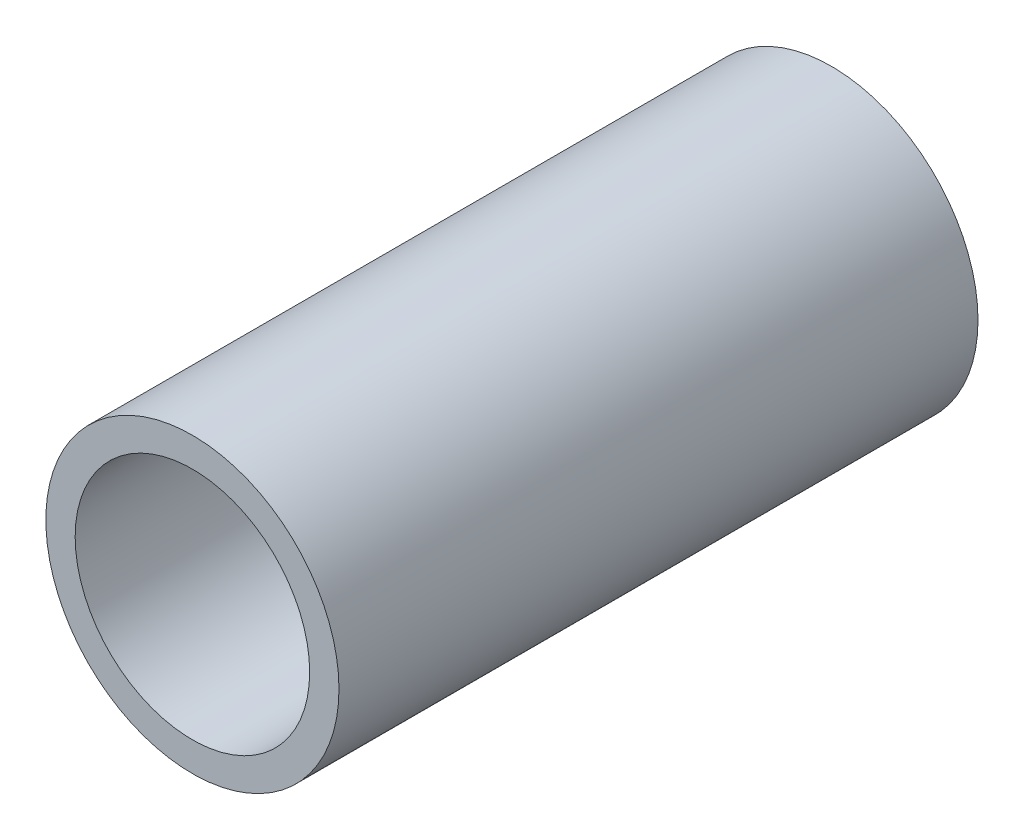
from build123d import *

# Parameters (mm, degrees)
ESQUISSE1_R        = 25
ESQUISSE1_R_2      = 20
EXTRU_MINCE1_DEPTH = 109


with BuildPart() as part:
    # Esquisse1 → Extru.-Mince1 (new body)
    with BuildSketch(Plane.XY):
        Circle(ESQUISSE1_R)
        Circle(ESQUISSE1_R_2, mode=Mode.SUBTRACT)
    extrude(amount=EXTRU_MINCE1_DEPTH)


solid = part.part
